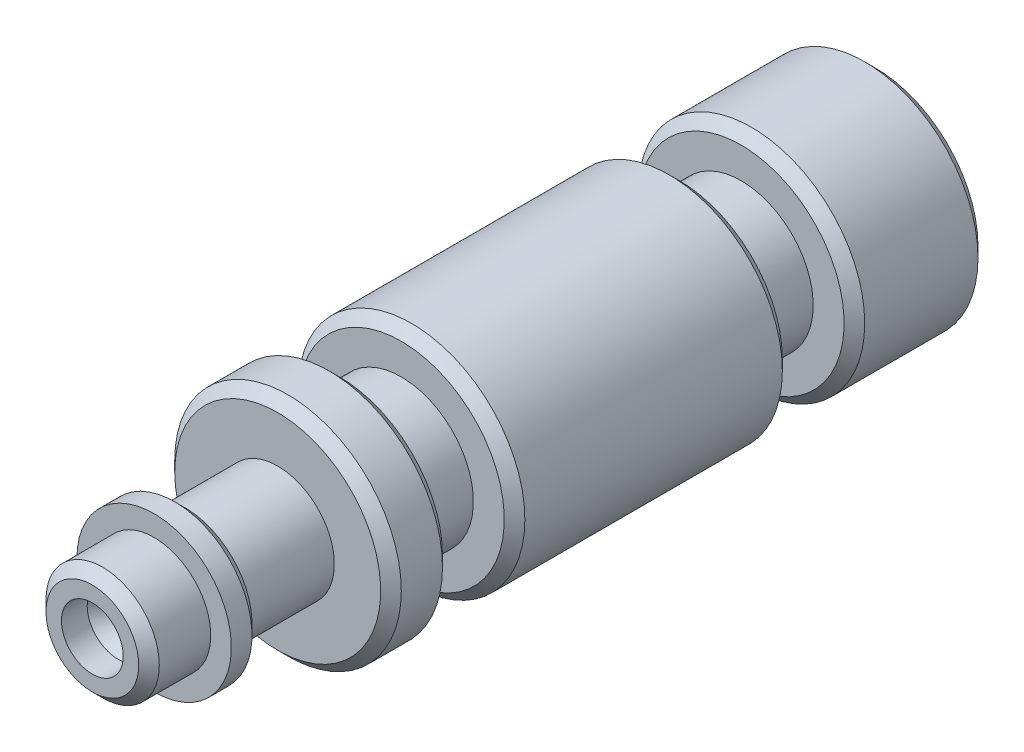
from build123d import *

# Parameters (mm, degrees)
ESQUISSE1_R          = 5.5
BASE_EXTRUSION_DEPTH = 38
ESQUISSE2_W          = 3
ESQUISSE2_H          = 2
CHANFREIN1_SIZE      = 0.5


with BuildPart() as part:
    # Esquisse1 → Base-Extrusion (new body)
    with BuildSketch(Plane.XY):
        with Locations(Location((0, 0, 0), (0, 0, 180))):
            Circle(ESQUISSE1_R)
    extrude(amount=BASE_EXTRUSION_DEPTH)

    # Esquisse2 → Enl_vement de mati_re-R_volution1 (revolve, cut)
    with BuildSketch(Plane(origin=(0, 0, 0), x_dir=(0, 0, -1), z_dir=(1, 0, 0)), mode=Mode.PRIVATE) as enl_vement_de_mati_re_r_volution1_sk:
        with BuildLine():
            Line((0, 0), (0, 4.5))
            ThreePointArc((0, 4.5), (-2.79950918, 3.767426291), (-5.155253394, 2.086835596))
            ThreePointArc((-5.155253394, 2.086835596), (-5.780805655, 1.125664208), (-6, 0))
            Line((-6, 0), (0, 0))
        make_face()
        with Locations((-8, 4.5)):
            Rectangle(ESQUISSE2_W, ESQUISSE2_H)
        with Locations((-24.5, 4.5)):
            Rectangle(ESQUISSE2_W, ESQUISSE2_H)
        Polygon((-29, 5.5), (-38, 5.5), (-38, 2.75), (-35, 2.75), (-35, 3.75), (-34, 3.75), (-33.5, 3.25), (-33.5, 2.75), (-29, 2.75), align=None)
        Polygon((-35.5, 0.75), (-36.75, 1.5), (-38, 1.5), (-38, 0), (-35.5, 0), align=None)
    revolve(enl_vement_de_mati_re_r_volution1_sk.sketch.rotate(Axis((0, 0, 0), (0, 0, 1)), 90), axis=Axis((0, 0, 0), (0, 0, 1)), mode=Mode.SUBTRACT)

    # Chanfrein1
    chanfrein1_edges = [part.edges().sort_by_distance(p)[0] for p in [
        (5.5, 0, 0),
        (5.5, 0, 6.5),
        (5.5, 0, 9.5),
        (5.5, 0, 23),
        (5.5, 0, 26),
        (5.5, 0, 29),
        (2.75, 0, 38),
    ]]
    chamfer(chanfrein1_edges, length=CHANFREIN1_SIZE)


solid = part.part
